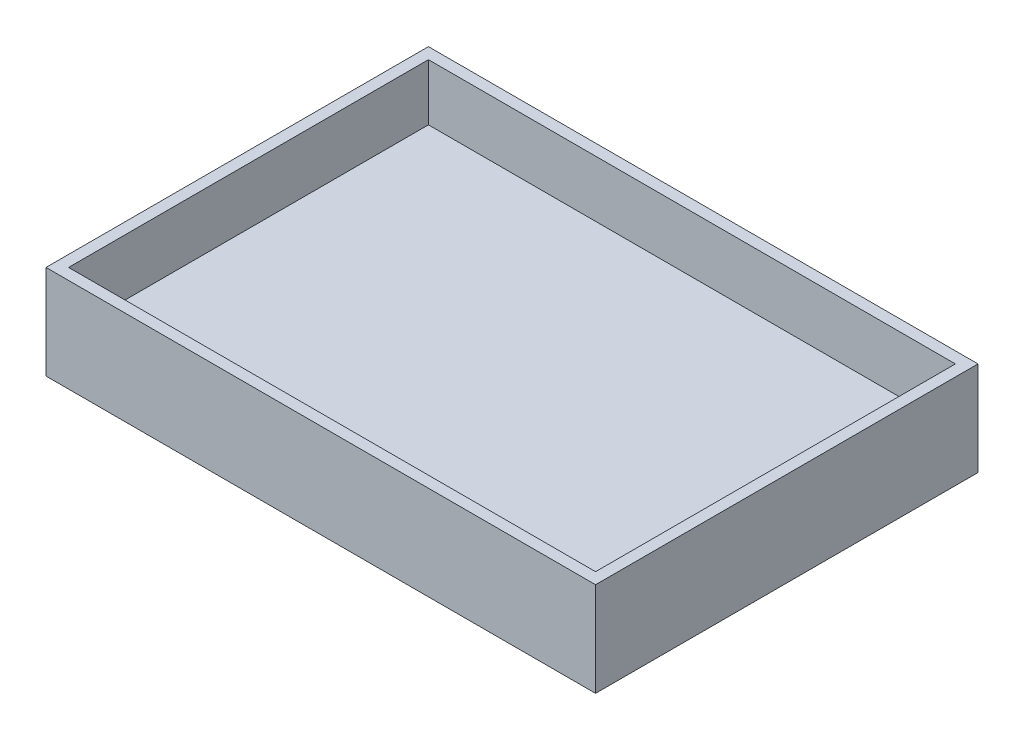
ISO-10303-21;
HEADER;
FILE_DESCRIPTION(('STEP AP214'),'2;1');
FILE_NAME('part.step','',(''),(''),'','','');
FILE_SCHEMA(('AUTOMOTIVE_DESIGN { 1 0 10303 214 1 1 1 1 }'));
ENDSEC;
DATA;
#1=APPLICATION_CONTEXT('core data for automotive mechanical design processes');
#2=APPLICATION_PROTOCOL_DEFINITION('international standard','automotive_design',2000,#1);
#3=PRODUCT_CONTEXT('',#1,'mechanical');
#4=PRODUCT('Part','Part','',(#3));
#5=PRODUCT_RELATED_PRODUCT_CATEGORY('part','',(#4));
#6=PRODUCT_DEFINITION_FORMATION('','',#4);
#7=PRODUCT_DEFINITION_CONTEXT('part definition',#1,'design');
#8=PRODUCT_DEFINITION('design','',#6,#7);
#9=PRODUCT_DEFINITION_SHAPE('','',#8);
#10=(LENGTH_UNIT() NAMED_UNIT(*) SI_UNIT(.MILLI.,.METRE.));
#11=(NAMED_UNIT(*) PLANE_ANGLE_UNIT() SI_UNIT($,.RADIAN.));
#12=(NAMED_UNIT(*) SI_UNIT($,.STERADIAN.) SOLID_ANGLE_UNIT());
#13=UNCERTAINTY_MEASURE_WITH_UNIT(LENGTH_MEASURE(1.E-05),#10,'distance_accuracy_value','');
#14=(GEOMETRIC_REPRESENTATION_CONTEXT(3) GLOBAL_UNCERTAINTY_ASSIGNED_CONTEXT((#13)) GLOBAL_UNIT_ASSIGNED_CONTEXT((#10,
#11,#12)) REPRESENTATION_CONTEXT('',''));
#15=CARTESIAN_POINT('',(0.,0.,0.));
#16=DIRECTION('',(0.,0.,1.));
#17=DIRECTION('',(1.,0.,0.));
#18=AXIS2_PLACEMENT_3D('',#15,#16,#17);
#19=CARTESIAN_POINT('',(-73.,25.,-50.8));
#20=DIRECTION('',(1.,0.,0.));
#21=DIRECTION('',(0.,0.,-1.));
#22=AXIS2_PLACEMENT_3D('',#19,#20,#21);
#23=PLANE('',#22);
#24=DIRECTION('',(0.,0.,1.));
#25=VECTOR('',#24,1.);
#26=CARTESIAN_POINT('',(-73.,0.,-50.8));
#27=LINE('',#26,#25);
#28=CARTESIAN_POINT('',(-73.,0.,-50.8));
#29=VERTEX_POINT('',#28);
#30=CARTESIAN_POINT('',(-73.,0.,50.8));
#31=VERTEX_POINT('',#30);
#32=EDGE_CURVE('E162',#29,#31,#27,.T.);
#33=ORIENTED_EDGE('',*,*,#32,.T.);
#34=DIRECTION('',(0.,-1.,0.));
#35=VECTOR('',#34,1.);
#36=CARTESIAN_POINT('',(-73.,25.,50.8));
#37=LINE('',#36,#35);
#38=CARTESIAN_POINT('',(-73.,25.,50.8));
#39=VERTEX_POINT('',#38);
#40=EDGE_CURVE('E11',#39,#31,#37,.T.);
#41=ORIENTED_EDGE('',*,*,#40,.F.);
#42=DIRECTION('',(0.,0.,1.));
#43=VECTOR('',#42,1.);
#44=CARTESIAN_POINT('',(-73.,25.,-50.8));
#45=LINE('',#44,#43);
#46=CARTESIAN_POINT('',(-73.,25.,-50.8));
#47=VERTEX_POINT('',#46);
#48=EDGE_CURVE('E168',#47,#39,#45,.T.);
#49=ORIENTED_EDGE('',*,*,#48,.F.);
#50=DIRECTION('',(0.,-1.,0.));
#51=VECTOR('',#50,1.);
#52=CARTESIAN_POINT('',(-73.,25.,-50.8));
#53=LINE('',#52,#51);
#54=EDGE_CURVE('E178',#47,#29,#53,.T.);
#55=ORIENTED_EDGE('',*,*,#54,.T.);
#56=EDGE_LOOP('',(#33,#41,#49,#55));
#57=FACE_BOUND('',#56,.T.);
#58=ADVANCED_FACE('F43',(#57),#23,.F.);
#59=CARTESIAN_POINT('',(-73.,25.,50.8));
#60=DIRECTION('',(0.,0.,-1.));
#61=DIRECTION('',(-1.,0.,0.));
#62=AXIS2_PLACEMENT_3D('',#59,#60,#61);
#63=PLANE('',#62);
#64=DIRECTION('',(1.,0.,0.));
#65=VECTOR('',#64,1.);
#66=CARTESIAN_POINT('',(-73.,0.,50.8));
#67=LINE('',#66,#65);
#68=CARTESIAN_POINT('',(73.,0.,50.8));
#69=VERTEX_POINT('',#68);
#70=EDGE_CURVE('E182',#31,#69,#67,.T.);
#71=ORIENTED_EDGE('',*,*,#70,.T.);
#72=DIRECTION('',(0.,-1.,0.));
#73=VECTOR('',#72,1.);
#74=CARTESIAN_POINT('',(73.,25.,50.8));
#75=LINE('',#74,#73);
#76=CARTESIAN_POINT('',(73.,25.,50.8));
#77=VERTEX_POINT('',#76);
#78=EDGE_CURVE('E51',#77,#69,#75,.T.);
#79=ORIENTED_EDGE('',*,*,#78,.F.);
#80=DIRECTION('',(1.,0.,0.));
#81=VECTOR('',#80,1.);
#82=CARTESIAN_POINT('',(-73.,25.,50.8));
#83=LINE('',#82,#81);
#84=EDGE_CURVE('E95',#39,#77,#83,.T.);
#85=ORIENTED_EDGE('',*,*,#84,.F.);
#86=ORIENTED_EDGE('',*,*,#40,.T.);
#87=EDGE_LOOP('',(#71,#79,#85,#86));
#88=FACE_BOUND('',#87,.T.);
#89=ADVANCED_FACE('F217',(#88),#63,.F.);
#90=CARTESIAN_POINT('',(73.,25.,-50.8));
#91=DIRECTION('',(-1.,0.,0.));
#92=DIRECTION('',(0.,0.,1.));
#93=AXIS2_PLACEMENT_3D('',#90,#91,#92);
#94=PLANE('',#93);
#95=DIRECTION('',(0.,0.,-1.));
#96=VECTOR('',#95,1.);
#97=CARTESIAN_POINT('',(73.,0.,-50.8));
#98=LINE('',#97,#96);
#99=CARTESIAN_POINT('',(73.,0.,-50.8));
#100=VERTEX_POINT('',#99);
#101=EDGE_CURVE('E185',#69,#100,#98,.T.);
#102=ORIENTED_EDGE('',*,*,#101,.T.);
#103=DIRECTION('',(0.,-1.,0.));
#104=VECTOR('',#103,1.);
#105=CARTESIAN_POINT('',(73.,25.,-50.8));
#106=LINE('',#105,#104);
#107=CARTESIAN_POINT('',(73.,25.,-50.8));
#108=VERTEX_POINT('',#107);
#109=EDGE_CURVE('E192',#108,#100,#106,.T.);
#110=ORIENTED_EDGE('',*,*,#109,.F.);
#111=DIRECTION('',(0.,0.,-1.));
#112=VECTOR('',#111,1.);
#113=CARTESIAN_POINT('',(73.,25.,-50.8));
#114=LINE('',#113,#112);
#115=EDGE_CURVE('E173',#77,#108,#114,.T.);
#116=ORIENTED_EDGE('',*,*,#115,.F.);
#117=ORIENTED_EDGE('',*,*,#78,.T.);
#118=EDGE_LOOP('',(#102,#110,#116,#117));
#119=FACE_BOUND('',#118,.T.);
#120=ADVANCED_FACE('F199',(#119),#94,.F.);
#121=CARTESIAN_POINT('',(-73.,25.,-50.8));
#122=DIRECTION('',(0.,0.,1.));
#123=DIRECTION('',(1.,0.,0.));
#124=AXIS2_PLACEMENT_3D('',#121,#122,#123);
#125=PLANE('',#124);
#126=DIRECTION('',(-1.,0.,0.));
#127=VECTOR('',#126,1.);
#128=CARTESIAN_POINT('',(-73.,0.,-50.8));
#129=LINE('',#128,#127);
#130=EDGE_CURVE('E88',#100,#29,#129,.T.);
#131=ORIENTED_EDGE('',*,*,#130,.T.);
#132=ORIENTED_EDGE('',*,*,#54,.F.);
#133=DIRECTION('',(-1.,0.,0.));
#134=VECTOR('',#133,1.);
#135=CARTESIAN_POINT('',(-73.,25.,-50.8));
#136=LINE('',#135,#134);
#137=EDGE_CURVE('E67',#108,#47,#136,.T.);
#138=ORIENTED_EDGE('',*,*,#137,.F.);
#139=ORIENTED_EDGE('',*,*,#109,.T.);
#140=EDGE_LOOP('',(#131,#132,#138,#139));
#141=FACE_BOUND('',#140,.T.);
#142=ADVANCED_FACE('F207',(#141),#125,.F.);
#143=CARTESIAN_POINT('',(0.,25.,0.));
#144=DIRECTION('',(0.,1.,0.));
#145=DIRECTION('',(0.,0.,1.));
#146=AXIS2_PLACEMENT_3D('',#143,#144,#145);
#147=PLANE('',#146);
#148=DIRECTION('',(0.,0.,1.));
#149=VECTOR('',#148,1.);
#150=CARTESIAN_POINT('',(-70.,25.,-47.8));
#151=LINE('',#150,#149);
#152=CARTESIAN_POINT('',(-70.,25.,-47.8));
#153=VERTEX_POINT('',#152);
#154=CARTESIAN_POINT('',(-70.,25.,47.8));
#155=VERTEX_POINT('',#154);
#156=EDGE_CURVE('E58',#153,#155,#151,.T.);
#157=ORIENTED_EDGE('',*,*,#156,.F.);
#158=DIRECTION('',(-1.,0.,0.));
#159=VECTOR('',#158,1.);
#160=CARTESIAN_POINT('',(-70.,25.,-47.8));
#161=LINE('',#160,#159);
#162=CARTESIAN_POINT('',(70.,25.,-47.8));
#163=VERTEX_POINT('',#162);
#164=EDGE_CURVE('E140',#163,#153,#161,.T.);
#165=ORIENTED_EDGE('',*,*,#164,.F.);
#166=DIRECTION('',(0.,0.,-1.));
#167=VECTOR('',#166,1.);
#168=CARTESIAN_POINT('',(70.,25.,-47.8));
#169=LINE('',#168,#167);
#170=CARTESIAN_POINT('',(70.,25.,47.8));
#171=VERTEX_POINT('',#170);
#172=EDGE_CURVE('E144',#171,#163,#169,.T.);
#173=ORIENTED_EDGE('',*,*,#172,.F.);
#174=DIRECTION('',(1.,0.,0.));
#175=VECTOR('',#174,1.);
#176=CARTESIAN_POINT('',(-70.,25.,47.8));
#177=LINE('',#176,#175);
#178=EDGE_CURVE('E153',#155,#171,#177,.T.);
#179=ORIENTED_EDGE('',*,*,#178,.F.);
#180=EDGE_LOOP('',(#157,#165,#173,#179));
#181=FACE_BOUND('',#180,.T.);
#182=ORIENTED_EDGE('',*,*,#48,.T.);
#183=ORIENTED_EDGE('',*,*,#84,.T.);
#184=ORIENTED_EDGE('',*,*,#115,.T.);
#185=ORIENTED_EDGE('',*,*,#137,.T.);
#186=EDGE_LOOP('',(#182,#183,#184,#185));
#187=FACE_BOUND('',#186,.T.);
#188=ADVANCED_FACE('F209',(#181,#187),#147,.T.);
#189=CARTESIAN_POINT('',(0.,0.,0.));
#190=DIRECTION('',(0.,1.,0.));
#191=DIRECTION('',(0.,0.,1.));
#192=AXIS2_PLACEMENT_3D('',#189,#190,#191);
#193=PLANE('',#192);
#194=ORIENTED_EDGE('',*,*,#32,.F.);
#195=ORIENTED_EDGE('',*,*,#130,.F.);
#196=ORIENTED_EDGE('',*,*,#101,.F.);
#197=ORIENTED_EDGE('',*,*,#70,.F.);
#198=EDGE_LOOP('',(#194,#195,#196,#197));
#199=FACE_BOUND('',#198,.T.);
#200=ADVANCED_FACE('F203',(#199),#193,.F.);
#201=CARTESIAN_POINT('',(-70.,10.,-47.8));
#202=DIRECTION('',(-1.,0.,0.));
#203=DIRECTION('',(0.,0.,1.));
#204=AXIS2_PLACEMENT_3D('',#201,#202,#203);
#205=PLANE('',#204);
#206=ORIENTED_EDGE('',*,*,#156,.T.);
#207=DIRECTION('',(0.,1.,0.));
#208=VECTOR('',#207,1.);
#209=CARTESIAN_POINT('',(-70.,10.,47.8));
#210=LINE('',#209,#208);
#211=CARTESIAN_POINT('',(-70.,10.,47.8));
#212=VERTEX_POINT('',#211);
#213=EDGE_CURVE('E115',#212,#155,#210,.T.);
#214=ORIENTED_EDGE('',*,*,#213,.F.);
#215=DIRECTION('',(0.,0.,1.));
#216=VECTOR('',#215,1.);
#217=CARTESIAN_POINT('',(-70.,10.,-47.8));
#218=LINE('',#217,#216);
#219=CARTESIAN_POINT('',(-70.,10.,-47.8));
#220=VERTEX_POINT('',#219);
#221=EDGE_CURVE('E119',#220,#212,#218,.T.);
#222=ORIENTED_EDGE('',*,*,#221,.F.);
#223=DIRECTION('',(0.,1.,0.));
#224=VECTOR('',#223,1.);
#225=CARTESIAN_POINT('',(-70.,10.,-47.8));
#226=LINE('',#225,#224);
#227=EDGE_CURVE('E159',#220,#153,#226,.T.);
#228=ORIENTED_EDGE('',*,*,#227,.T.);
#229=EDGE_LOOP('',(#206,#214,#222,#228));
#230=FACE_BOUND('',#229,.T.);
#231=ADVANCED_FACE('F117',(#230),#205,.F.);
#232=CARTESIAN_POINT('',(-70.,10.,-47.8));
#233=DIRECTION('',(0.,0.,-1.));
#234=DIRECTION('',(-1.,0.,0.));
#235=AXIS2_PLACEMENT_3D('',#232,#233,#234);
#236=PLANE('',#235);
#237=ORIENTED_EDGE('',*,*,#164,.T.);
#238=ORIENTED_EDGE('',*,*,#227,.F.);
#239=DIRECTION('',(-1.,0.,0.));
#240=VECTOR('',#239,1.);
#241=CARTESIAN_POINT('',(-70.,10.,-47.8));
#242=LINE('',#241,#240);
#243=CARTESIAN_POINT('',(70.,10.,-47.8));
#244=VERTEX_POINT('',#243);
#245=EDGE_CURVE('E126',#244,#220,#242,.T.);
#246=ORIENTED_EDGE('',*,*,#245,.F.);
#247=DIRECTION('',(0.,1.,0.));
#248=VECTOR('',#247,1.);
#249=CARTESIAN_POINT('',(70.,10.,-47.8));
#250=LINE('',#249,#248);
#251=EDGE_CURVE('E163',#244,#163,#250,.T.);
#252=ORIENTED_EDGE('',*,*,#251,.T.);
#253=EDGE_LOOP('',(#237,#238,#246,#252));
#254=FACE_BOUND('',#253,.T.);
#255=ADVANCED_FACE('F260',(#254),#236,.F.);
#256=CARTESIAN_POINT('',(70.,10.,-47.8));
#257=DIRECTION('',(1.,0.,0.));
#258=DIRECTION('',(0.,0.,-1.));
#259=AXIS2_PLACEMENT_3D('',#256,#257,#258);
#260=PLANE('',#259);
#261=ORIENTED_EDGE('',*,*,#172,.T.);
#262=ORIENTED_EDGE('',*,*,#251,.F.);
#263=DIRECTION('',(0.,0.,-1.));
#264=VECTOR('',#263,1.);
#265=CARTESIAN_POINT('',(70.,10.,-47.8));
#266=LINE('',#265,#264);
#267=CARTESIAN_POINT('',(70.,10.,47.8));
#268=VERTEX_POINT('',#267);
#269=EDGE_CURVE('E135',#268,#244,#266,.T.);
#270=ORIENTED_EDGE('',*,*,#269,.F.);
#271=DIRECTION('',(0.,1.,0.));
#272=VECTOR('',#271,1.);
#273=CARTESIAN_POINT('',(70.,10.,47.8));
#274=LINE('',#273,#272);
#275=EDGE_CURVE('E125',#268,#171,#274,.T.);
#276=ORIENTED_EDGE('',*,*,#275,.T.);
#277=EDGE_LOOP('',(#261,#262,#270,#276));
#278=FACE_BOUND('',#277,.T.);
#279=ADVANCED_FACE('F270',(#278),#260,.F.);
#280=CARTESIAN_POINT('',(-70.,10.,47.8));
#281=DIRECTION('',(0.,0.,1.));
#282=DIRECTION('',(1.,0.,0.));
#283=AXIS2_PLACEMENT_3D('',#280,#281,#282);
#284=PLANE('',#283);
#285=ORIENTED_EDGE('',*,*,#178,.T.);
#286=ORIENTED_EDGE('',*,*,#275,.F.);
#287=DIRECTION('',(1.,0.,0.));
#288=VECTOR('',#287,1.);
#289=CARTESIAN_POINT('',(-70.,10.,47.8));
#290=LINE('',#289,#288);
#291=EDGE_CURVE('E129',#212,#268,#290,.T.);
#292=ORIENTED_EDGE('',*,*,#291,.F.);
#293=ORIENTED_EDGE('',*,*,#213,.T.);
#294=EDGE_LOOP('',(#285,#286,#292,#293));
#295=FACE_BOUND('',#294,.T.);
#296=ADVANCED_FACE('F130',(#295),#284,.F.);
#297=CARTESIAN_POINT('',(0.,10.,0.));
#298=DIRECTION('',(0.,1.,0.));
#299=DIRECTION('',(0.,0.,1.));
#300=AXIS2_PLACEMENT_3D('',#297,#298,#299);
#301=PLANE('',#300);
#302=ORIENTED_EDGE('',*,*,#221,.T.);
#303=ORIENTED_EDGE('',*,*,#291,.T.);
#304=ORIENTED_EDGE('',*,*,#269,.T.);
#305=ORIENTED_EDGE('',*,*,#245,.T.);
#306=EDGE_LOOP('',(#302,#303,#304,#305));
#307=FACE_BOUND('',#306,.T.);
#308=ADVANCED_FACE('F137',(#307),#301,.T.);
#309=CLOSED_SHELL('',(#58,#89,#120,#142,#188,#200,#231,#255,#279,#296,#308));
#310=MANIFOLD_SOLID_BREP('B2',#309);
#311=ADVANCED_BREP_SHAPE_REPRESENTATION('',(#18,#310),#14);
#312=SHAPE_DEFINITION_REPRESENTATION(#9,#311);
ENDSEC;
END-ISO-10303-21;
